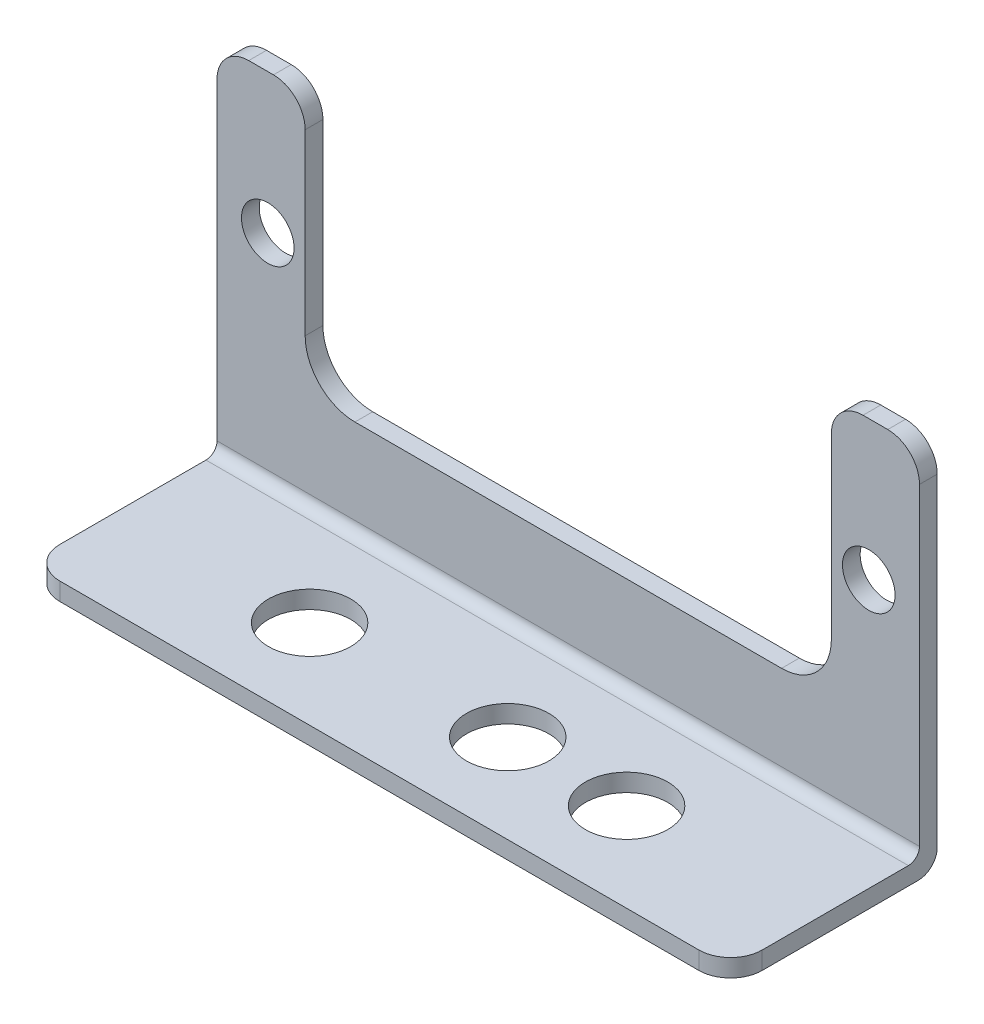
from build123d import *

# Parameters (mm, degrees)
BOSS_EXTRUDE1_DEPTH = 56.2864
SKETCH3_R           = 3.302
CUT_EXTRUDE2_DEPTH  = 66.249510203
CUT_EXTRUDE3_DEPTH  = 66.541214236
FILLET1_R           = 2.54
FILLET2_R           = 2.54
SKETCH6_R           = 2.1082
CUT_EXTRUDE4_DEPTH  = 66.541214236


with BuildPart() as part:
    # Sketch1 → Boss-Extrude1 (new body)
    with BuildSketch(Plane(origin=(0, 0, 0), x_dir=(0, 0, -1), z_dir=(1, 0, 0))):
        with BuildLine():
            Line((-1.524, 0), (-16.5608, 0))
            Line((-16.5608, 0), (-16.5608, 1.4224))
            Line((-16.5608, 1.4224), (-2.3114, 1.4224))
            ThreePointArc((-2.3114, 1.4224), (-1.682782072, 1.682782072), (-1.4224, 2.3114))
            Line((-1.4224, 2.3114), (-1.4224, 29.972))
            Line((-1.4224, 29.972), (0, 29.972))
            Line((0, 29.972), (0, 1.524))
            ThreePointArc((0, 1.524), (-0.446369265, 0.446369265), (-1.524, 0))
        make_face()
    extrude(amount=BOSS_EXTRUDE1_DEPTH)

    # Sketch3 → Cut-Extrude2 (cut, through all)
    with BuildSketch(Plane(origin=(0, 1.4224, 0), x_dir=(1, 0, 0), z_dir=(0, 1, 0))):
        with Locations(Location((15.4432, -9.4488, 0), (0, 0, 270))):
            Circle(SKETCH3_R)
        with Locations(Location((40.8432, -9.4488, 0), (0, 0, 270))):
            Circle(SKETCH3_R)
        with Locations(Location((31.3182, -9.4488, 0), (0, 0, 270))):
            Circle(SKETCH3_R)
    extrude(amount=-CUT_EXTRUDE2_DEPTH, mode=Mode.SUBTRACT)

    # Sketch4 → Cut-Extrude3 (cut, through all)
    with BuildSketch(Plane.XY.offset(1.4224)):
        with BuildLine():
            Line((28.1432, 9.144), (11.049, 9.144))
            ThreePointArc((11.049, 9.144), (8.229199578, 10.311999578), (7.0612, 13.1318))
            Line((7.0612, 13.1318), (7.0612, 29.972))
            Line((7.0612, 29.972), (49.2252, 29.972))
            Line((49.2252, 29.972), (49.2252, 13.1318))
            ThreePointArc((49.2252, 13.1318), (48.057200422, 10.311999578), (45.2374, 9.144))
            Line((45.2374, 9.144), (28.1432, 9.144))
        make_face()
    extrude(amount=-CUT_EXTRUDE3_DEPTH, mode=Mode.SUBTRACT)

    # Fillet1
    fillet1_edges = [part.edges().sort_by_distance(p)[0] for p in [
        (56.2864, 29.972, 0.7112),
        (7.0612, 29.972, 0.7112),
        (49.2252, 29.972, 0.7112),
        (0, 29.972, 0.7112),
    ]]
    fillet(fillet1_edges, radius=FILLET1_R)

    # Fillet2
    fillet2_edges = [part.edges().sort_by_distance(p)[0] for p in [
        (0, 0.7112, 16.5608),
        (56.2864, 0.7112, 16.5608),
    ]]
    fillet(fillet2_edges, radius=FILLET2_R)

    # Sketch6 → Cut-Extrude4 (cut, through all)
    with BuildSketch(Plane.XY.offset(1.4224)):
        with Locations((4.064, 18.7706)):
            Circle(SKETCH6_R)
        with Locations((52.2224, 18.7706)):
            Circle(SKETCH6_R)
    extrude(amount=-CUT_EXTRUDE4_DEPTH, mode=Mode.SUBTRACT)


solid = part.part
